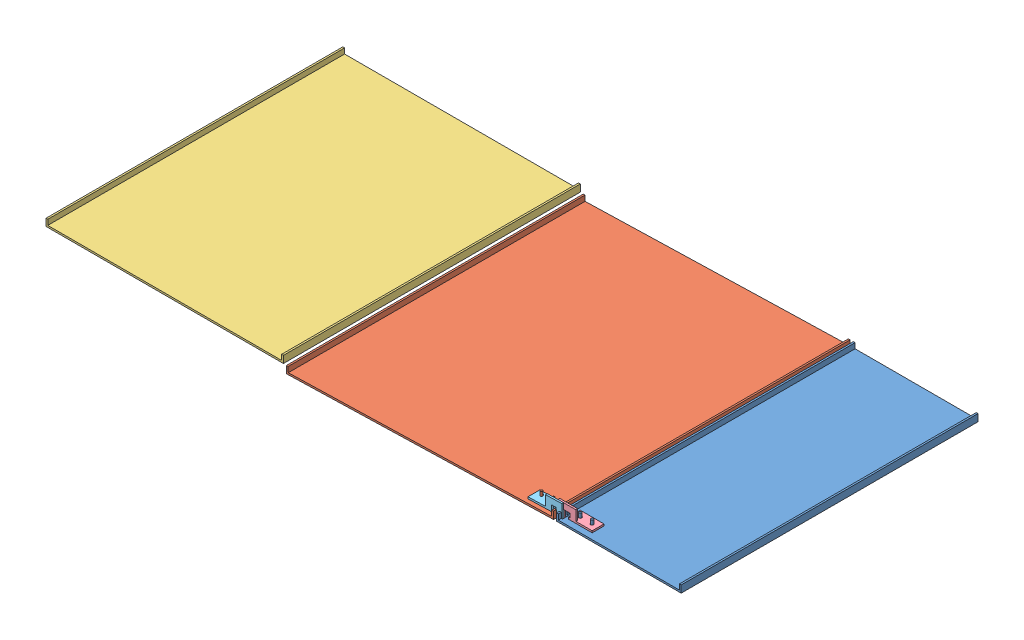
SolidWorks assembly Baugruppe1.SLDASM, configuration Standard (file format 4400). Lengths in mm.
Overall size (1070 35.56 500).
5 component instances, 5 part files, 11 mates.
Components (placement in the parent):
- Rechts-1: Rechts.SLDPRT [Standard] at (-87.3937 -7.3111 0) size (210 13 500)
- Tuer-1: Tuer.SLDPRT [Standard] at (-542.2091 -19.7457 0) x (0.999622 0.02748 0) z (0 0 1) size (450 13 500)
- Links-1: Links.SLDPRT [Standard] at (-947.3937 -7.3111 0) size (400 12 500)
- Schanier 1-1: Schanier 1.SLDPRT [Standard] at (-77.3937 -4.3111 490) x (1 0 0) z (0 1 0) size (57.5 20 27.5)
- Schanier 2-1: Schanier 2.SLDPRT [Standard] at (-142.4426 -5.7548 493) x (0.999622 0.02748 0) z (-0.02748 0.999622 0) size (57.5 20 27.5)
Mates (geometry in assembly coordinates):
- Deckungsgleich1: coincident aligned: plane of Rechts-1 through (122.6063 4.6889 500) normal (0 0 1); plane of Tuer-1 through (-92.7088 4.6158 500) normal (0 0 1)
- Deckungsgleich2: coincident aligned: plane of Tuer-1 through (-92.7088 4.6158 500) normal (0 0 1); plane of Links-1 through (-547.3937 4.6889 500) normal (0 0 1)
- Deckungsgleich3: coincident aligned: plane of Rechts-1 through (-87.3937 -7.3111 500) normal (0 -1 0); plane of Links-1 through (-947.3937 -7.3111 500) normal (0 -1 0)
- Abstand1: distance = 1070 mm anti-aligned: plane of Rechts-1 through (122.6063 -7.3111 500) normal (1 0 0); plane of Links-1 through (-947.3937 4.6889 500) normal (-1 0 0)
- Konzentrisch1: concentric aligned: cylinder of Rechts-1 through (-67.3937 5.6889 480) axis (0 -1 0) radius 2; cylinder of Schanier 1-1 through (-67.3937 -1.3111 480) axis (0 -1 0) radius 2.5
- Konzentrisch2: concentric anti-aligned: cylinder of Rechts-1 through (-47.3937 5.6889 480) axis (0 -1 0) radius 2; circle of Schanier 1-1
- Deckungsgleich5: coincident anti-aligned: plane of Rechts-1 through (-87.3937 -4.3111 500) normal (0 1 0); plane of Schanier 1-1 through (-77.3937 -4.3111 470) normal (0 -1 0)
- Konzentrisch3: concentric aligned: cylinder of Tuer-1 through (-112.7287 5.0659 480) axis (0.02748 -0.999622 0) radius 2; cylinder of Schanier 2-1 through (-112.5363 -1.9315 480) axis (0.02748 -0.999622 0) radius 2
- Konzentrisch4: concentric aligned: cylinder of Tuer-1 through (-132.7212 4.5163 480) axis (0.02748 -0.999622 0) radius 2; cylinder of Schanier 2-1 through (-132.5288 -2.4811 480) axis (0.02748 -0.999622 0) radius 2
- Deckungsgleich6: coincident anti-aligned: plane of Tuer-1 through (-542.2915 -16.7468 500) normal (-0.02748 0.999622 0); plane of Schanier 2-1 through (-142.4426 -5.7548 473) normal (0.02748 -0.999622 0)
- Konzentrisch6: concentric aligned: cylinder of Schanier 1-1 through (-89.8937 -6.8111 487) axis (0 0 1) radius 2.5; cylinder of Schanier 2-1 through (-89.8937 -6.8111 490) axis (0 0 1) radius 2.5
